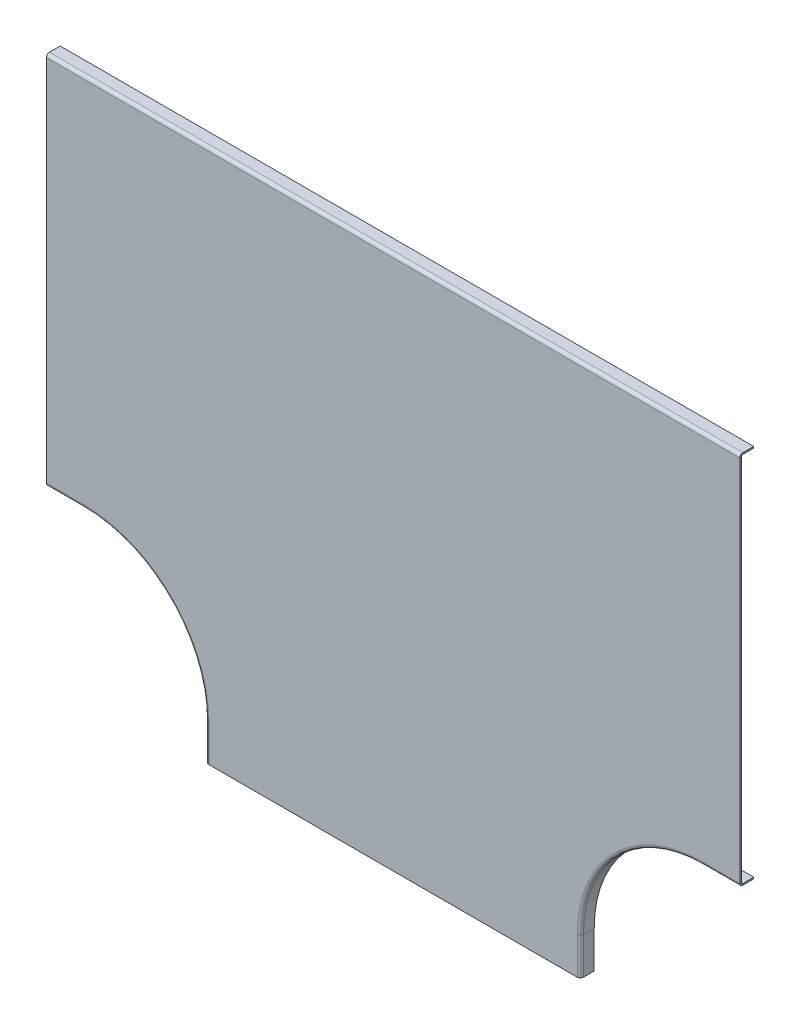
ISO-10303-21;
HEADER;
FILE_DESCRIPTION(('STEP AP214'),'2;1');
FILE_NAME('part.step','',(''),(''),'','','');
FILE_SCHEMA(('AUTOMOTIVE_DESIGN { 1 0 10303 214 1 1 1 1 }'));
ENDSEC;
DATA;
#1=APPLICATION_CONTEXT('core data for automotive mechanical design processes');
#2=APPLICATION_PROTOCOL_DEFINITION('international standard','automotive_design',2000,#1);
#3=PRODUCT_CONTEXT('',#1,'mechanical');
#4=PRODUCT('Part','Part','',(#3));
#5=PRODUCT_RELATED_PRODUCT_CATEGORY('part','',(#4));
#6=PRODUCT_DEFINITION_FORMATION('','',#4);
#7=PRODUCT_DEFINITION_CONTEXT('part definition',#1,'design');
#8=PRODUCT_DEFINITION('design','',#6,#7);
#9=PRODUCT_DEFINITION_SHAPE('','',#8);
#10=(LENGTH_UNIT() NAMED_UNIT(*) SI_UNIT(.MILLI.,.METRE.));
#11=(NAMED_UNIT(*) PLANE_ANGLE_UNIT() SI_UNIT($,.RADIAN.));
#12=(NAMED_UNIT(*) SI_UNIT($,.STERADIAN.) SOLID_ANGLE_UNIT());
#13=UNCERTAINTY_MEASURE_WITH_UNIT(LENGTH_MEASURE(1.E-05),#10,'distance_accuracy_value','');
#14=(GEOMETRIC_REPRESENTATION_CONTEXT(3) GLOBAL_UNCERTAINTY_ASSIGNED_CONTEXT((#13)) GLOBAL_UNIT_ASSIGNED_CONTEXT((#10,
#11,#12)) REPRESENTATION_CONTEXT('',''));
#15=CARTESIAN_POINT('',(0.,0.,0.));
#16=DIRECTION('',(0.,0.,1.));
#17=DIRECTION('',(1.,0.,0.));
#18=AXIS2_PLACEMENT_3D('',#15,#16,#17);
#19=CARTESIAN_POINT('',(-361.048564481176,-315.184007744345,1.21412));
#20=DIRECTION('',(0.,0.,-1.));
#21=DIRECTION('',(-1.,0.,0.));
#22=AXIS2_PLACEMENT_3D('',#19,#20,#21);
#23=PLANE('',#22);
#24=DIRECTION('',(0.,-1.,0.));
#25=VECTOR('',#24,1.);
#26=CARTESIAN_POINT('',(-259.778564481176,-315.184007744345,1.21412));
#27=LINE('',#26,#25);
#28=CARTESIAN_POINT('',(-259.778564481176,-315.184007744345,1.21412));
#29=VERTEX_POINT('',#28);
#30=CARTESIAN_POINT('',(-259.778564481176,-345.184007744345,1.21412));
#31=VERTEX_POINT('',#30);
#32=EDGE_CURVE('E454',#29,#31,#27,.T.);
#33=ORIENTED_EDGE('',*,*,#32,.T.);
#34=DIRECTION('',(1.,0.,0.));
#35=VECTOR('',#34,1.);
#36=CARTESIAN_POINT('',(-261.048564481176,-345.184007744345,1.21412));
#37=LINE('',#36,#35);
#38=CARTESIAN_POINT('',(37.6814355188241,-345.184007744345,1.21412));
#39=VERTEX_POINT('',#38);
#40=EDGE_CURVE('E228',#31,#39,#37,.T.);
#41=ORIENTED_EDGE('',*,*,#40,.T.);
#42=DIRECTION('',(0.,1.,0.));
#43=VECTOR('',#42,1.);
#44=CARTESIAN_POINT('',(37.6814355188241,-345.184007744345,1.21412));
#45=LINE('',#44,#43);
#46=CARTESIAN_POINT('',(37.6814355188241,-315.184007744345,1.21412));
#47=VERTEX_POINT('',#46);
#48=EDGE_CURVE('E571',#39,#47,#45,.T.);
#49=ORIENTED_EDGE('',*,*,#48,.T.);
#50=CARTESIAN_POINT('',(138.951435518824,-315.184007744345,1.21412));
#51=DIRECTION('',(0.,0.,-1.));
#52=DIRECTION('',(-1.,0.,0.));
#53=AXIS2_PLACEMENT_3D('',#50,#51,#52);
#54=CIRCLE('',#53,101.27);
#55=CARTESIAN_POINT('',(138.951435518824,-213.914007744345,1.21412));
#56=VERTEX_POINT('',#55);
#57=EDGE_CURVE('E560',#47,#56,#54,.T.);
#58=ORIENTED_EDGE('',*,*,#57,.T.);
#59=DIRECTION('',(1.,0.,0.));
#60=VECTOR('',#59,1.);
#61=CARTESIAN_POINT('',(138.951435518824,-213.914007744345,1.21412));
#62=LINE('',#61,#60);
#63=CARTESIAN_POINT('',(168.951435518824,-213.914007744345,1.21412));
#64=VERTEX_POINT('',#63);
#65=EDGE_CURVE('E580',#56,#64,#62,.T.);
#66=ORIENTED_EDGE('',*,*,#65,.T.);
#67=DIRECTION('',(0.,1.,0.));
#68=VECTOR('',#67,1.);
#69=CARTESIAN_POINT('',(168.951435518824,-215.184007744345,1.21412));
#70=LINE('',#69,#68);
#71=CARTESIAN_POINT('',(168.951435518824,83.5459922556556,1.21411999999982));
#72=VERTEX_POINT('',#71);
#73=EDGE_CURVE('E14',#64,#72,#70,.T.);
#74=ORIENTED_EDGE('',*,*,#73,.T.);
#75=DIRECTION('',(1.,0.,0.));
#76=VECTOR('',#75,1.);
#77=CARTESIAN_POINT('',(168.951435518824,83.5459922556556,1.21411999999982));
#78=LINE('',#77,#76);
#79=CARTESIAN_POINT('',(-391.048564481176,83.5459922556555,1.21412));
#80=VERTEX_POINT('',#79);
#81=EDGE_CURVE('E692',#72,#80,#78,.F.);
#82=ORIENTED_EDGE('',*,*,#81,.T.);
#83=DIRECTION('',(0.,-1.,0.));
#84=VECTOR('',#83,1.);
#85=CARTESIAN_POINT('',(-391.048564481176,84.8159922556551,1.21412));
#86=LINE('',#85,#84);
#87=CARTESIAN_POINT('',(-391.048564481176,-213.914007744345,1.21412));
#88=VERTEX_POINT('',#87);
#89=EDGE_CURVE('E715',#80,#88,#86,.T.);
#90=ORIENTED_EDGE('',*,*,#89,.T.);
#91=DIRECTION('',(1.,0.,0.));
#92=VECTOR('',#91,1.);
#93=CARTESIAN_POINT('',(-391.048564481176,-213.914007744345,1.21412));
#94=LINE('',#93,#92);
#95=CARTESIAN_POINT('',(-361.048564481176,-213.914007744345,1.21412));
#96=VERTEX_POINT('',#95);
#97=EDGE_CURVE('E236',#88,#96,#94,.T.);
#98=ORIENTED_EDGE('',*,*,#97,.T.);
#99=CARTESIAN_POINT('',(-361.048564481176,-315.184007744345,1.21412));
#100=DIRECTION('',(0.,0.,-1.));
#101=DIRECTION('',(-1.,0.,0.));
#102=AXIS2_PLACEMENT_3D('',#99,#100,#101);
#103=CIRCLE('',#102,101.27);
#104=EDGE_CURVE('E455',#96,#29,#103,.T.);
#105=ORIENTED_EDGE('',*,*,#104,.T.);
#106=EDGE_LOOP('',(#33,#41,#49,#58,#66,#74,#82,#90,#98,#105));
#107=FACE_BOUND('',#106,.T.);
#108=ADVANCED_FACE('F219',(#107),#23,.F.);
#109=CARTESIAN_POINT('',(-361.048564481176,-315.184007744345,0.));
#110=DIRECTION('',(0.,0.,-1.));
#111=DIRECTION('',(-1.,0.,0.));
#112=AXIS2_PLACEMENT_3D('',#109,#110,#111);
#113=PLANE('',#112);
#114=DIRECTION('',(1.,0.,0.));
#115=VECTOR('',#114,1.);
#116=CARTESIAN_POINT('',(-261.048564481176,-345.184007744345,0.));
#117=LINE('',#116,#115);
#118=CARTESIAN_POINT('',(-259.778564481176,-345.184007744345,0.));
#119=VERTEX_POINT('',#118);
#120=CARTESIAN_POINT('',(37.6814355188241,-345.184007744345,0.));
#121=VERTEX_POINT('',#120);
#122=EDGE_CURVE('E718',#119,#121,#117,.T.);
#123=ORIENTED_EDGE('',*,*,#122,.F.);
#124=DIRECTION('',(0.,-1.,0.));
#125=VECTOR('',#124,1.);
#126=CARTESIAN_POINT('',(-259.778564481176,-315.184007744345,0.));
#127=LINE('',#126,#125);
#128=CARTESIAN_POINT('',(-259.778564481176,-315.184007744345,0.));
#129=VERTEX_POINT('',#128);
#130=EDGE_CURVE('E244',#129,#119,#127,.T.);
#131=ORIENTED_EDGE('',*,*,#130,.F.);
#132=CARTESIAN_POINT('',(-361.048564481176,-315.184007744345,0.));
#133=DIRECTION('',(0.,0.,-1.));
#134=DIRECTION('',(0.,1.,0.));
#135=AXIS2_PLACEMENT_3D('',#132,#133,#134);
#136=CIRCLE('',#135,101.27);
#137=CARTESIAN_POINT('',(-361.048564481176,-213.914007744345,0.));
#138=VERTEX_POINT('',#137);
#139=EDGE_CURVE('E500',#138,#129,#136,.T.);
#140=ORIENTED_EDGE('',*,*,#139,.F.);
#141=DIRECTION('',(1.,0.,0.));
#142=VECTOR('',#141,1.);
#143=CARTESIAN_POINT('',(-391.048564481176,-213.914007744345,0.));
#144=LINE('',#143,#142);
#145=CARTESIAN_POINT('',(-391.048564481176,-213.914007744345,0.));
#146=VERTEX_POINT('',#145);
#147=EDGE_CURVE('E491',#146,#138,#144,.T.);
#148=ORIENTED_EDGE('',*,*,#147,.F.);
#149=DIRECTION('',(0.,-1.,0.));
#150=VECTOR('',#149,1.);
#151=CARTESIAN_POINT('',(-391.048564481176,84.8159922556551,0.));
#152=LINE('',#151,#150);
#153=CARTESIAN_POINT('',(-391.048564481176,83.5459922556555,-1.83880688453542E-13));
#154=VERTEX_POINT('',#153);
#155=EDGE_CURVE('E712',#154,#146,#152,.T.);
#156=ORIENTED_EDGE('',*,*,#155,.F.);
#157=DIRECTION('',(1.,0.,0.));
#158=VECTOR('',#157,1.);
#159=CARTESIAN_POINT('',(168.951435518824,83.5459922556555,-1.83880688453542E-13));
#160=LINE('',#159,#158);
#161=CARTESIAN_POINT('',(168.951435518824,83.5459922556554,0.));
#162=VERTEX_POINT('',#161);
#163=EDGE_CURVE('E704',#162,#154,#160,.F.);
#164=ORIENTED_EDGE('',*,*,#163,.F.);
#165=DIRECTION('',(0.,1.,0.));
#166=VECTOR('',#165,1.);
#167=CARTESIAN_POINT('',(168.951435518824,-215.184007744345,0.));
#168=LINE('',#167,#166);
#169=CARTESIAN_POINT('',(168.951435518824,-213.914007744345,0.));
#170=VERTEX_POINT('',#169);
#171=EDGE_CURVE('E223',#170,#162,#168,.T.);
#172=ORIENTED_EDGE('',*,*,#171,.F.);
#173=DIRECTION('',(1.,0.,0.));
#174=VECTOR('',#173,1.);
#175=CARTESIAN_POINT('',(138.951435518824,-213.914007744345,0.));
#176=LINE('',#175,#174);
#177=CARTESIAN_POINT('',(138.951435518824,-213.914007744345,0.));
#178=VERTEX_POINT('',#177);
#179=EDGE_CURVE('E623',#178,#170,#176,.T.);
#180=ORIENTED_EDGE('',*,*,#179,.F.);
#181=CARTESIAN_POINT('',(138.951435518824,-315.184007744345,0.));
#182=DIRECTION('',(0.,0.,-1.));
#183=DIRECTION('',(-1.,0.,0.));
#184=AXIS2_PLACEMENT_3D('',#181,#182,#183);
#185=CIRCLE('',#184,101.27);
#186=CARTESIAN_POINT('',(37.6814355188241,-315.184007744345,0.));
#187=VERTEX_POINT('',#186);
#188=EDGE_CURVE('E613',#187,#178,#185,.T.);
#189=ORIENTED_EDGE('',*,*,#188,.F.);
#190=DIRECTION('',(0.,1.,0.));
#191=VECTOR('',#190,1.);
#192=CARTESIAN_POINT('',(37.6814355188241,-345.184007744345,0.));
#193=LINE('',#192,#191);
#194=EDGE_CURVE('E604',#121,#187,#193,.T.);
#195=ORIENTED_EDGE('',*,*,#194,.F.);
#196=EDGE_LOOP('',(#123,#131,#140,#148,#156,#164,#172,#180,#189,#195));
#197=FACE_BOUND('',#196,.T.);
#198=ADVANCED_FACE('F729',(#197),#113,.T.);
#199=CARTESIAN_POINT('',(-261.048564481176,-345.184007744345,1.21412));
#200=DIRECTION('',(0.,1.,0.));
#201=DIRECTION('',(-1.,0.,0.));
#202=AXIS2_PLACEMENT_3D('',#199,#200,#201);
#203=PLANE('',#202);
#204=DIRECTION('',(0.,0.,1.));
#205=VECTOR('',#204,1.);
#206=CARTESIAN_POINT('',(37.6814355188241,-345.184007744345,0.));
#207=LINE('',#206,#205);
#208=EDGE_CURVE('E652',#121,#39,#207,.T.);
#209=ORIENTED_EDGE('',*,*,#208,.T.);
#210=ORIENTED_EDGE('',*,*,#40,.F.);
#211=DIRECTION('',(0.,0.,1.));
#212=VECTOR('',#211,1.);
#213=CARTESIAN_POINT('',(-259.778564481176,-345.184007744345,0.));
#214=LINE('',#213,#212);
#215=EDGE_CURVE('E540',#119,#31,#214,.T.);
#216=ORIENTED_EDGE('',*,*,#215,.F.);
#217=ORIENTED_EDGE('',*,*,#122,.T.);
#218=EDGE_LOOP('',(#209,#210,#216,#217));
#219=FACE_BOUND('',#218,.T.);
#220=ADVANCED_FACE('F834',(#219),#203,.F.);
#221=CARTESIAN_POINT('',(168.951435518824,-215.184007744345,1.21412));
#222=DIRECTION('',(-1.,0.,0.));
#223=DIRECTION('',(0.,0.,1.));
#224=AXIS2_PLACEMENT_3D('',#221,#222,#223);
#225=PLANE('',#224);
#226=DIRECTION('',(0.,1.20201311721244E-13,1.));
#227=VECTOR('',#226,1.);
#228=CARTESIAN_POINT('',(168.951435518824,83.5459922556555,-1.83880688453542E-13));
#229=LINE('',#228,#227);
#230=EDGE_CURVE('E698',#162,#72,#229,.T.);
#231=ORIENTED_EDGE('',*,*,#230,.T.);
#232=ORIENTED_EDGE('',*,*,#73,.F.);
#233=DIRECTION('',(0.,0.,1.));
#234=VECTOR('',#233,1.);
#235=CARTESIAN_POINT('',(168.951435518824,-213.914007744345,0.));
#236=LINE('',#235,#234);
#237=EDGE_CURVE('E655',#170,#64,#236,.T.);
#238=ORIENTED_EDGE('',*,*,#237,.F.);
#239=ORIENTED_EDGE('',*,*,#171,.T.);
#240=EDGE_LOOP('',(#231,#232,#238,#239));
#241=FACE_BOUND('',#240,.T.);
#242=ADVANCED_FACE('F724',(#241),#225,.F.);
#243=CARTESIAN_POINT('',(-391.048564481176,84.8159922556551,1.21412));
#244=DIRECTION('',(1.,0.,0.));
#245=DIRECTION('',(0.,1.,0.));
#246=AXIS2_PLACEMENT_3D('',#243,#244,#245);
#247=PLANE('',#246);
#248=ORIENTED_EDGE('',*,*,#155,.T.);
#249=DIRECTION('',(0.,0.,1.));
#250=VECTOR('',#249,1.);
#251=CARTESIAN_POINT('',(-391.048564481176,-213.914007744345,0.));
#252=LINE('',#251,#250);
#253=EDGE_CURVE('E537',#146,#88,#252,.T.);
#254=ORIENTED_EDGE('',*,*,#253,.T.);
#255=ORIENTED_EDGE('',*,*,#89,.F.);
#256=DIRECTION('',(0.,1.20201311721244E-13,1.));
#257=VECTOR('',#256,1.);
#258=CARTESIAN_POINT('',(-391.048564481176,83.5459922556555,-1.83880688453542E-13));
#259=LINE('',#258,#257);
#260=EDGE_CURVE('E709',#154,#80,#259,.T.);
#261=ORIENTED_EDGE('',*,*,#260,.F.);
#262=EDGE_LOOP('',(#248,#254,#255,#261));
#263=FACE_BOUND('',#262,.T.);
#264=ADVANCED_FACE('F221',(#263),#247,.F.);
#265=CARTESIAN_POINT('',(-391.048564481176,83.5459922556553,-1.27000000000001));
#266=DIRECTION('',(-1.,0.,0.));
#267=DIRECTION('',(0.,0.,1.));
#268=AXIS2_PLACEMENT_3D('',#265,#266,#267);
#269=PLANE('',#268);
#270=DIRECTION('',(0.,1.,0.));
#271=VECTOR('',#270,1.);
#272=CARTESIAN_POINT('',(-391.048564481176,84.8159922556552,-1.26999999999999));
#273=LINE('',#272,#271);
#274=CARTESIAN_POINT('',(-391.048564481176,84.8159922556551,-1.27000000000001));
#275=VERTEX_POINT('',#274);
#276=CARTESIAN_POINT('',(-391.048564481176,86.0301122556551,-1.27));
#277=VERTEX_POINT('',#276);
#278=EDGE_CURVE('E660',#275,#277,#273,.T.);
#279=ORIENTED_EDGE('',*,*,#278,.F.);
#280=CARTESIAN_POINT('',(-391.048564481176,83.5459922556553,-1.27000000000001));
#281=DIRECTION('',(1.,0.,0.));
#282=DIRECTION('',(0.,0.,-1.));
#283=AXIS2_PLACEMENT_3D('',#280,#281,#282);
#284=CIRCLE('',#283,1.26999999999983);
#285=EDGE_CURVE('E701',#154,#275,#284,.F.);
#286=ORIENTED_EDGE('',*,*,#285,.F.);
#287=ORIENTED_EDGE('',*,*,#260,.T.);
#288=CARTESIAN_POINT('',(-391.048564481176,83.5459922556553,-1.27000000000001));
#289=DIRECTION('',(1.,0.,0.));
#290=DIRECTION('',(0.,0.,-1.));
#291=AXIS2_PLACEMENT_3D('',#288,#289,#290);
#292=CIRCLE('',#291,2.48411999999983);
#293=EDGE_CURVE('E694',#80,#277,#292,.F.);
#294=ORIENTED_EDGE('',*,*,#293,.T.);
#295=EDGE_LOOP('',(#279,#286,#287,#294));
#296=FACE_BOUND('',#295,.T.);
#297=ADVANCED_FACE('F762',(#296),#269,.T.);
#298=CARTESIAN_POINT('',(168.951435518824,83.5459922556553,-1.27000000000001));
#299=DIRECTION('',(-1.,0.,0.));
#300=DIRECTION('',(0.,0.,1.));
#301=AXIS2_PLACEMENT_3D('',#298,#299,#300);
#302=PLANE('',#301);
#303=CARTESIAN_POINT('',(168.951435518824,83.5459922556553,-1.27000000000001));
#304=DIRECTION('',(1.,0.,0.));
#305=DIRECTION('',(0.,0.,-1.));
#306=AXIS2_PLACEMENT_3D('',#303,#304,#305);
#307=CIRCLE('',#306,1.26999999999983);
#308=CARTESIAN_POINT('',(168.951435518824,84.8159922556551,-1.27000000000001));
#309=VERTEX_POINT('',#308);
#310=EDGE_CURVE('E691',#309,#162,#307,.T.);
#311=ORIENTED_EDGE('',*,*,#310,.F.);
#312=DIRECTION('',(0.,1.,0.));
#313=VECTOR('',#312,1.);
#314=CARTESIAN_POINT('',(168.951435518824,84.8159922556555,-1.27000000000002));
#315=LINE('',#314,#313);
#316=CARTESIAN_POINT('',(168.951435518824,86.0301122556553,-1.27000000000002));
#317=VERTEX_POINT('',#316);
#318=EDGE_CURVE('E664',#309,#317,#315,.T.);
#319=ORIENTED_EDGE('',*,*,#318,.T.);
#320=CARTESIAN_POINT('',(168.951435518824,83.5459922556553,-1.27000000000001));
#321=DIRECTION('',(1.,0.,0.));
#322=DIRECTION('',(0.,0.,-1.));
#323=AXIS2_PLACEMENT_3D('',#320,#321,#322);
#324=CIRCLE('',#323,2.48411999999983);
#325=EDGE_CURVE('E695',#317,#72,#324,.T.);
#326=ORIENTED_EDGE('',*,*,#325,.T.);
#327=ORIENTED_EDGE('',*,*,#230,.F.);
#328=EDGE_LOOP('',(#311,#319,#326,#327));
#329=FACE_BOUND('',#328,.T.);
#330=ADVANCED_FACE('F735',(#329),#302,.F.);
#331=CARTESIAN_POINT('',(168.951435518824,83.5459922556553,-1.27000000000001));
#332=DIRECTION('',(1.,0.,0.));
#333=DIRECTION('',(0.,1.,0.));
#334=AXIS2_PLACEMENT_3D('',#331,#332,#333);
#335=CYLINDRICAL_SURFACE('',#334,2.48411999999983);
#336=ORIENTED_EDGE('',*,*,#81,.F.);
#337=ORIENTED_EDGE('',*,*,#325,.F.);
#338=DIRECTION('',(-1.,0.,0.));
#339=VECTOR('',#338,1.);
#340=CARTESIAN_POINT('',(-391.048564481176,86.0301122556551,-1.26999999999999));
#341=LINE('',#340,#339);
#342=EDGE_CURVE('E667',#317,#277,#341,.T.);
#343=ORIENTED_EDGE('',*,*,#342,.T.);
#344=ORIENTED_EDGE('',*,*,#293,.F.);
#345=EDGE_LOOP('',(#336,#337,#343,#344));
#346=FACE_BOUND('',#345,.T.);
#347=ADVANCED_FACE('F760',(#346),#335,.T.);
#348=CARTESIAN_POINT('',(168.951435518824,83.5459922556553,-1.27000000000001));
#349=DIRECTION('',(1.,0.,0.));
#350=DIRECTION('',(0.,1.,0.));
#351=AXIS2_PLACEMENT_3D('',#348,#349,#350);
#352=CYLINDRICAL_SURFACE('',#351,1.26999999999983);
#353=ORIENTED_EDGE('',*,*,#163,.T.);
#354=ORIENTED_EDGE('',*,*,#285,.T.);
#355=DIRECTION('',(1.,0.,0.));
#356=VECTOR('',#355,1.);
#357=CARTESIAN_POINT('',(-391.048564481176,84.8159922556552,-1.26999999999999));
#358=LINE('',#357,#356);
#359=EDGE_CURVE('E662',#275,#309,#358,.T.);
#360=ORIENTED_EDGE('',*,*,#359,.T.);
#361=ORIENTED_EDGE('',*,*,#310,.T.);
#362=EDGE_LOOP('',(#353,#354,#360,#361));
#363=FACE_BOUND('',#362,.T.);
#364=ADVANCED_FACE('F737',(#363),#352,.F.);
#365=CARTESIAN_POINT('',(168.951435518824,86.0301122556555,-10.));
#366=DIRECTION('',(-1.,0.,0.));
#367=DIRECTION('',(0.,-1.,0.));
#368=AXIS2_PLACEMENT_3D('',#365,#366,#367);
#369=PLANE('',#368);
#370=ORIENTED_EDGE('',*,*,#318,.F.);
#371=DIRECTION('',(0.,0.,-1.));
#372=VECTOR('',#371,1.);
#373=CARTESIAN_POINT('',(168.951435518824,84.8159922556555,-10.));
#374=LINE('',#373,#372);
#375=CARTESIAN_POINT('',(168.951435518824,84.8159922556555,-10.));
#376=VERTEX_POINT('',#375);
#377=EDGE_CURVE('E671',#309,#376,#374,.T.);
#378=ORIENTED_EDGE('',*,*,#377,.T.);
#379=DIRECTION('',(0.,-1.,0.));
#380=VECTOR('',#379,1.);
#381=CARTESIAN_POINT('',(168.951435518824,86.0301122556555,-10.));
#382=LINE('',#381,#380);
#383=CARTESIAN_POINT('',(168.951435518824,86.0301122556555,-10.));
#384=VERTEX_POINT('',#383);
#385=EDGE_CURVE('E688',#384,#376,#382,.T.);
#386=ORIENTED_EDGE('',*,*,#385,.F.);
#387=DIRECTION('',(0.,0.,-1.));
#388=VECTOR('',#387,1.);
#389=CARTESIAN_POINT('',(168.951435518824,86.0301122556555,-10.));
#390=LINE('',#389,#388);
#391=EDGE_CURVE('E672',#317,#384,#390,.T.);
#392=ORIENTED_EDGE('',*,*,#391,.F.);
#393=EDGE_LOOP('',(#370,#378,#386,#392));
#394=FACE_BOUND('',#393,.T.);
#395=ADVANCED_FACE('F754',(#394),#369,.F.);
#396=CARTESIAN_POINT('',(-391.048564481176,86.0301122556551,0.));
#397=DIRECTION('',(1.,0.,0.));
#398=DIRECTION('',(0.,1.,0.));
#399=AXIS2_PLACEMENT_3D('',#396,#397,#398);
#400=PLANE('',#399);
#401=ORIENTED_EDGE('',*,*,#278,.T.);
#402=DIRECTION('',(0.,0.,1.));
#403=VECTOR('',#402,1.);
#404=CARTESIAN_POINT('',(-391.048564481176,86.0301122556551,0.));
#405=LINE('',#404,#403);
#406=CARTESIAN_POINT('',(-391.048564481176,86.0301122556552,-10.));
#407=VERTEX_POINT('',#406);
#408=EDGE_CURVE('E677',#407,#277,#405,.T.);
#409=ORIENTED_EDGE('',*,*,#408,.F.);
#410=DIRECTION('',(0.,-1.,0.));
#411=VECTOR('',#410,1.);
#412=CARTESIAN_POINT('',(-391.048564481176,86.0301122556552,-10.));
#413=LINE('',#412,#411);
#414=CARTESIAN_POINT('',(-391.048564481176,84.8159922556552,-10.));
#415=VERTEX_POINT('',#414);
#416=EDGE_CURVE('E680',#407,#415,#413,.T.);
#417=ORIENTED_EDGE('',*,*,#416,.T.);
#418=DIRECTION('',(0.,0.,1.));
#419=VECTOR('',#418,1.);
#420=CARTESIAN_POINT('',(-391.048564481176,84.8159922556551,0.));
#421=LINE('',#420,#419);
#422=EDGE_CURVE('E675',#415,#275,#421,.T.);
#423=ORIENTED_EDGE('',*,*,#422,.T.);
#424=EDGE_LOOP('',(#401,#409,#417,#423));
#425=FACE_BOUND('',#424,.T.);
#426=ADVANCED_FACE('F745',(#425),#400,.F.);
#427=CARTESIAN_POINT('',(-391.048564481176,86.0301122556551,0.));
#428=DIRECTION('',(0.,-1.,0.));
#429=DIRECTION('',(0.,0.,-1.));
#430=AXIS2_PLACEMENT_3D('',#427,#428,#429);
#431=PLANE('',#430);
#432=ORIENTED_EDGE('',*,*,#342,.F.);
#433=ORIENTED_EDGE('',*,*,#391,.T.);
#434=DIRECTION('',(-1.,0.,0.));
#435=VECTOR('',#434,1.);
#436=CARTESIAN_POINT('',(-391.048564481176,86.0301122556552,-10.));
#437=LINE('',#436,#435);
#438=EDGE_CURVE('E674',#384,#407,#437,.T.);
#439=ORIENTED_EDGE('',*,*,#438,.T.);
#440=ORIENTED_EDGE('',*,*,#408,.T.);
#441=EDGE_LOOP('',(#432,#433,#439,#440));
#442=FACE_BOUND('',#441,.T.);
#443=ADVANCED_FACE('F757',(#442),#431,.F.);
#444=CARTESIAN_POINT('',(-391.048564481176,84.8159922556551,0.));
#445=DIRECTION('',(0.,-1.,0.));
#446=DIRECTION('',(0.,0.,-1.));
#447=AXIS2_PLACEMENT_3D('',#444,#445,#446);
#448=PLANE('',#447);
#449=ORIENTED_EDGE('',*,*,#377,.F.);
#450=ORIENTED_EDGE('',*,*,#359,.F.);
#451=ORIENTED_EDGE('',*,*,#422,.F.);
#452=DIRECTION('',(-1.,0.,0.));
#453=VECTOR('',#452,1.);
#454=CARTESIAN_POINT('',(-391.048564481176,84.8159922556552,-10.));
#455=LINE('',#454,#453);
#456=EDGE_CURVE('E682',#376,#415,#455,.T.);
#457=ORIENTED_EDGE('',*,*,#456,.F.);
#458=EDGE_LOOP('',(#449,#450,#451,#457));
#459=FACE_BOUND('',#458,.T.);
#460=ADVANCED_FACE('F742',(#459),#448,.T.);
#461=CARTESIAN_POINT('',(-391.048564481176,86.0301122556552,-10.));
#462=DIRECTION('',(0.,0.,1.));
#463=DIRECTION('',(0.,-1.,0.));
#464=AXIS2_PLACEMENT_3D('',#461,#462,#463);
#465=PLANE('',#464);
#466=ORIENTED_EDGE('',*,*,#456,.T.);
#467=ORIENTED_EDGE('',*,*,#416,.F.);
#468=ORIENTED_EDGE('',*,*,#438,.F.);
#469=ORIENTED_EDGE('',*,*,#385,.T.);
#470=EDGE_LOOP('',(#466,#467,#468,#469));
#471=FACE_BOUND('',#470,.T.);
#472=ADVANCED_FACE('F750',(#471),#465,.F.);
#473=CARTESIAN_POINT('',(168.951435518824,-213.914007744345,-1.27));
#474=DIRECTION('',(1.,0.,0.));
#475=DIRECTION('',(0.,0.,-1.));
#476=AXIS2_PLACEMENT_3D('',#473,#474,#475);
#477=PLANE('',#476);
#478=DIRECTION('',(0.,-1.,0.));
#479=VECTOR('',#478,1.);
#480=CARTESIAN_POINT('',(168.951435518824,-215.184007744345,-1.27));
#481=LINE('',#480,#479);
#482=CARTESIAN_POINT('',(168.951435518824,-215.184007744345,-1.27));
#483=VERTEX_POINT('',#482);
#484=CARTESIAN_POINT('',(168.951435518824,-216.398127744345,-1.26999999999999));
#485=VERTEX_POINT('',#484);
#486=EDGE_CURVE('E658',#483,#485,#481,.T.);
#487=ORIENTED_EDGE('',*,*,#486,.F.);
#488=CARTESIAN_POINT('',(168.951435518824,-213.914007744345,-1.27));
#489=DIRECTION('',(-1.,0.,0.));
#490=DIRECTION('',(0.,0.,-1.));
#491=AXIS2_PLACEMENT_3D('',#488,#489,#490);
#492=CIRCLE('',#491,1.27);
#493=EDGE_CURVE('E619',#170,#483,#492,.F.);
#494=ORIENTED_EDGE('',*,*,#493,.F.);
#495=ORIENTED_EDGE('',*,*,#237,.T.);
#496=CARTESIAN_POINT('',(168.951435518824,-213.914007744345,-1.27));
#497=DIRECTION('',(1.,0.,0.));
#498=DIRECTION('',(0.,0.,-1.));
#499=AXIS2_PLACEMENT_3D('',#496,#497,#498);
#500=CIRCLE('',#499,2.48412);
#501=EDGE_CURVE('E551',#64,#485,#500,.T.);
#502=ORIENTED_EDGE('',*,*,#501,.T.);
#503=EDGE_LOOP('',(#487,#494,#495,#502));
#504=FACE_BOUND('',#503,.T.);
#505=ADVANCED_FACE('F770',(#504),#477,.T.);
#506=CARTESIAN_POINT('',(37.6814355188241,-345.184007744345,-1.27));
#507=DIRECTION('',(0.,1.,0.));
#508=DIRECTION('',(0.,0.,1.));
#509=AXIS2_PLACEMENT_3D('',#506,#507,#508);
#510=PLANE('',#509);
#511=ORIENTED_EDGE('',*,*,#208,.F.);
#512=CARTESIAN_POINT('',(37.6814355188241,-345.184007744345,-1.27));
#513=DIRECTION('',(0.,-1.,0.));
#514=DIRECTION('',(0.,0.,-1.));
#515=AXIS2_PLACEMENT_3D('',#512,#513,#514);
#516=CIRCLE('',#515,1.27);
#517=CARTESIAN_POINT('',(38.9514355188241,-345.184007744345,-1.27));
#518=VERTEX_POINT('',#517);
#519=EDGE_CURVE('E545',#121,#518,#516,.F.);
#520=ORIENTED_EDGE('',*,*,#519,.T.);
#521=DIRECTION('',(1.,0.,0.));
#522=VECTOR('',#521,1.);
#523=CARTESIAN_POINT('',(38.9514355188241,-345.184007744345,-1.27));
#524=LINE('',#523,#522);
#525=CARTESIAN_POINT('',(40.1655555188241,-345.184007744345,-1.26999999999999));
#526=VERTEX_POINT('',#525);
#527=EDGE_CURVE('E650',#518,#526,#524,.T.);
#528=ORIENTED_EDGE('',*,*,#527,.T.);
#529=CARTESIAN_POINT('',(37.6814355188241,-345.184007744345,-1.27));
#530=DIRECTION('',(0.,1.,0.));
#531=DIRECTION('',(0.,0.,1.));
#532=AXIS2_PLACEMENT_3D('',#529,#530,#531);
#533=CIRCLE('',#532,2.48412);
#534=EDGE_CURVE('E586',#39,#526,#533,.T.);
#535=ORIENTED_EDGE('',*,*,#534,.F.);
#536=EDGE_LOOP('',(#511,#520,#528,#535));
#537=FACE_BOUND('',#536,.T.);
#538=ADVANCED_FACE('F846',(#537),#510,.F.);
#539=CARTESIAN_POINT('',(38.9514355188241,-345.184007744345,0.));
#540=DIRECTION('',(0.,-1.,0.));
#541=DIRECTION('',(0.,0.,-1.));
#542=AXIS2_PLACEMENT_3D('',#539,#540,#541);
#543=PLANE('',#542);
#544=ORIENTED_EDGE('',*,*,#527,.F.);
#545=DIRECTION('',(0.,0.,-1.));
#546=VECTOR('',#545,1.);
#547=CARTESIAN_POINT('',(38.9514355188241,-345.184007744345,0.));
#548=LINE('',#547,#546);
#549=CARTESIAN_POINT('',(38.9514355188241,-345.184007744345,-10.000000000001));
#550=VERTEX_POINT('',#549);
#551=EDGE_CURVE('E599',#518,#550,#548,.T.);
#552=ORIENTED_EDGE('',*,*,#551,.T.);
#553=DIRECTION('',(1.,0.,0.));
#554=VECTOR('',#553,1.);
#555=CARTESIAN_POINT('',(38.9514355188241,-345.184007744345,-10.000000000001));
#556=LINE('',#555,#554);
#557=CARTESIAN_POINT('',(40.1655555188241,-345.184007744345,-10.000000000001));
#558=VERTEX_POINT('',#557);
#559=EDGE_CURVE('E648',#550,#558,#556,.T.);
#560=ORIENTED_EDGE('',*,*,#559,.T.);
#561=DIRECTION('',(0.,0.,-1.));
#562=VECTOR('',#561,1.);
#563=CARTESIAN_POINT('',(40.1655555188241,-345.184007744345,0.));
#564=LINE('',#563,#562);
#565=EDGE_CURVE('E583',#526,#558,#564,.T.);
#566=ORIENTED_EDGE('',*,*,#565,.F.);
#567=EDGE_LOOP('',(#544,#552,#560,#566));
#568=FACE_BOUND('',#567,.T.);
#569=ADVANCED_FACE('F856',(#568),#543,.T.);
#570=CARTESIAN_POINT('',(38.9514355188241,-345.184007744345,-10.000000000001));
#571=DIRECTION('',(0.,0.,-1.));
#572=DIRECTION('',(0.,1.,0.));
#573=AXIS2_PLACEMENT_3D('',#570,#571,#572);
#574=PLANE('',#573);
#575=ORIENTED_EDGE('',*,*,#559,.F.);
#576=DIRECTION('',(0.,1.,0.));
#577=VECTOR('',#576,1.);
#578=CARTESIAN_POINT('',(38.9514355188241,-345.184007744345,-10.000000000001));
#579=LINE('',#578,#577);
#580=CARTESIAN_POINT('',(38.9514355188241,-315.184007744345,-10.000000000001));
#581=VERTEX_POINT('',#580);
#582=EDGE_CURVE('E618',#550,#581,#579,.T.);
#583=ORIENTED_EDGE('',*,*,#582,.T.);
#584=DIRECTION('',(1.,0.,0.));
#585=VECTOR('',#584,1.);
#586=CARTESIAN_POINT('',(38.9514355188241,-315.184007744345,-10.000000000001));
#587=LINE('',#586,#585);
#588=CARTESIAN_POINT('',(40.1655555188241,-315.184007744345,-10.000000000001));
#589=VERTEX_POINT('',#588);
#590=EDGE_CURVE('E646',#581,#589,#587,.T.);
#591=ORIENTED_EDGE('',*,*,#590,.T.);
#592=DIRECTION('',(0.,1.,0.));
#593=VECTOR('',#592,1.);
#594=CARTESIAN_POINT('',(40.1655555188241,-345.184007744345,-10.000000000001));
#595=LINE('',#594,#593);
#596=EDGE_CURVE('E566',#558,#589,#595,.T.);
#597=ORIENTED_EDGE('',*,*,#596,.F.);
#598=EDGE_LOOP('',(#575,#583,#591,#597));
#599=FACE_BOUND('',#598,.T.);
#600=ADVANCED_FACE('F857',(#599),#574,.T.);
#601=CARTESIAN_POINT('',(138.951435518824,-315.184007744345,-10.000000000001));
#602=DIRECTION('',(0.,0.,1.));
#603=DIRECTION('',(1.,0.,0.));
#604=AXIS2_PLACEMENT_3D('',#601,#602,#603);
#605=PLANE('',#604);
#606=ORIENTED_EDGE('',*,*,#590,.F.);
#607=CARTESIAN_POINT('',(138.951435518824,-315.184007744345,-10.000000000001));
#608=DIRECTION('',(0.,0.,-1.));
#609=DIRECTION('',(-1.,0.,0.));
#610=AXIS2_PLACEMENT_3D('',#607,#608,#609);
#611=CIRCLE('',#610,100.);
#612=CARTESIAN_POINT('',(138.951435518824,-215.184007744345,-10.000000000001));
#613=VERTEX_POINT('',#612);
#614=EDGE_CURVE('E629',#581,#613,#611,.T.);
#615=ORIENTED_EDGE('',*,*,#614,.T.);
#616=DIRECTION('',(0.,-1.,0.));
#617=VECTOR('',#616,1.);
#618=CARTESIAN_POINT('',(138.951435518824,-215.184007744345,-10.000000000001));
#619=LINE('',#618,#617);
#620=CARTESIAN_POINT('',(138.951435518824,-216.398127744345,-10.000000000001));
#621=VERTEX_POINT('',#620);
#622=EDGE_CURVE('E644',#613,#621,#619,.T.);
#623=ORIENTED_EDGE('',*,*,#622,.T.);
#624=CARTESIAN_POINT('',(138.951435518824,-315.184007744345,-10.000000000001));
#625=DIRECTION('',(0.,0.,-1.));
#626=DIRECTION('',(-1.,0.,0.));
#627=AXIS2_PLACEMENT_3D('',#624,#625,#626);
#628=CIRCLE('',#627,98.78588);
#629=EDGE_CURVE('E555',#589,#621,#628,.T.);
#630=ORIENTED_EDGE('',*,*,#629,.F.);
#631=EDGE_LOOP('',(#606,#615,#623,#630));
#632=FACE_BOUND('',#631,.T.);
#633=ADVANCED_FACE('F798',(#632),#605,.F.);
#634=CARTESIAN_POINT('',(138.951435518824,-215.184007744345,-10.000000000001));
#635=DIRECTION('',(0.,0.,-1.));
#636=DIRECTION('',(1.,0.,0.));
#637=AXIS2_PLACEMENT_3D('',#634,#635,#636);
#638=PLANE('',#637);
#639=ORIENTED_EDGE('',*,*,#622,.F.);
#640=DIRECTION('',(1.,0.,0.));
#641=VECTOR('',#640,1.);
#642=CARTESIAN_POINT('',(138.951435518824,-215.184007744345,-10.000000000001));
#643=LINE('',#642,#641);
#644=CARTESIAN_POINT('',(168.951435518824,-215.184007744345,-10.000000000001));
#645=VERTEX_POINT('',#644);
#646=EDGE_CURVE('E589',#613,#645,#643,.T.);
#647=ORIENTED_EDGE('',*,*,#646,.T.);
#648=DIRECTION('',(0.,-1.,0.));
#649=VECTOR('',#648,1.);
#650=CARTESIAN_POINT('',(168.951435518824,-215.184007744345,-10.000000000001));
#651=LINE('',#650,#649);
#652=CARTESIAN_POINT('',(168.951435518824,-216.398127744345,-10.000000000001));
#653=VERTEX_POINT('',#652);
#654=EDGE_CURVE('E577',#645,#653,#651,.T.);
#655=ORIENTED_EDGE('',*,*,#654,.T.);
#656=DIRECTION('',(1.,0.,0.));
#657=VECTOR('',#656,1.);
#658=CARTESIAN_POINT('',(138.951435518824,-216.398127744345,-10.000000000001));
#659=LINE('',#658,#657);
#660=EDGE_CURVE('E574',#621,#653,#659,.T.);
#661=ORIENTED_EDGE('',*,*,#660,.F.);
#662=EDGE_LOOP('',(#639,#647,#655,#661));
#663=FACE_BOUND('',#662,.T.);
#664=ADVANCED_FACE('F802',(#663),#638,.T.);
#665=CARTESIAN_POINT('',(168.951435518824,-215.184007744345,0.));
#666=DIRECTION('',(-1.,0.,0.));
#667=DIRECTION('',(0.,0.,-1.));
#668=AXIS2_PLACEMENT_3D('',#665,#666,#667);
#669=PLANE('',#668);
#670=DIRECTION('',(0.,0.,-1.));
#671=VECTOR('',#670,1.);
#672=CARTESIAN_POINT('',(168.951435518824,-215.184007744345,0.));
#673=LINE('',#672,#671);
#674=EDGE_CURVE('E626',#483,#645,#673,.T.);
#675=ORIENTED_EDGE('',*,*,#674,.F.);
#676=ORIENTED_EDGE('',*,*,#486,.T.);
#677=DIRECTION('',(0.,0.,-1.));
#678=VECTOR('',#677,1.);
#679=CARTESIAN_POINT('',(168.951435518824,-216.398127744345,0.));
#680=LINE('',#679,#678);
#681=EDGE_CURVE('E550',#485,#653,#680,.T.);
#682=ORIENTED_EDGE('',*,*,#681,.T.);
#683=ORIENTED_EDGE('',*,*,#654,.F.);
#684=EDGE_LOOP('',(#675,#676,#682,#683));
#685=FACE_BOUND('',#684,.T.);
#686=ADVANCED_FACE('F813',(#685),#669,.F.);
#687=CARTESIAN_POINT('',(138.951435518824,-216.398127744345,0.));
#688=DIRECTION('',(0.,-1.,0.));
#689=DIRECTION('',(0.,0.,-1.));
#690=AXIS2_PLACEMENT_3D('',#687,#688,#689);
#691=PLANE('',#690);
#692=ORIENTED_EDGE('',*,*,#660,.T.);
#693=ORIENTED_EDGE('',*,*,#681,.F.);
#694=DIRECTION('',(1.,0.,0.));
#695=VECTOR('',#694,1.);
#696=CARTESIAN_POINT('',(138.951435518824,-216.398127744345,-1.26999999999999));
#697=LINE('',#696,#695);
#698=CARTESIAN_POINT('',(138.951435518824,-216.398127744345,-1.26999999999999));
#699=VERTEX_POINT('',#698);
#700=EDGE_CURVE('E547',#699,#485,#697,.T.);
#701=ORIENTED_EDGE('',*,*,#700,.F.);
#702=DIRECTION('',(0.,0.,-1.));
#703=VECTOR('',#702,1.);
#704=CARTESIAN_POINT('',(138.951435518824,-216.398127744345,0.));
#705=LINE('',#704,#703);
#706=EDGE_CURVE('E552',#699,#621,#705,.T.);
#707=ORIENTED_EDGE('',*,*,#706,.T.);
#708=EDGE_LOOP('',(#692,#693,#701,#707));
#709=FACE_BOUND('',#708,.T.);
#710=ADVANCED_FACE('F777',(#709),#691,.T.);
#711=CARTESIAN_POINT('',(138.951435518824,-213.914007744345,-1.27));
#712=DIRECTION('',(1.,0.,0.));
#713=DIRECTION('',(0.,0.,-1.));
#714=AXIS2_PLACEMENT_3D('',#711,#712,#713);
#715=CYLINDRICAL_SURFACE('',#714,2.48412);
#716=ORIENTED_EDGE('',*,*,#700,.T.);
#717=ORIENTED_EDGE('',*,*,#501,.F.);
#718=ORIENTED_EDGE('',*,*,#65,.F.);
#719=CARTESIAN_POINT('',(138.951435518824,-213.914007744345,-1.27));
#720=DIRECTION('',(1.,0.,0.));
#721=DIRECTION('',(0.,0.,-1.));
#722=AXIS2_PLACEMENT_3D('',#719,#720,#721);
#723=CIRCLE('',#722,2.48412);
#724=EDGE_CURVE('E557',#56,#699,#723,.T.);
#725=ORIENTED_EDGE('',*,*,#724,.T.);
#726=EDGE_LOOP('',(#716,#717,#718,#725));
#727=FACE_BOUND('',#726,.T.);
#728=ADVANCED_FACE('F772',(#727),#715,.T.);
#729=CARTESIAN_POINT('',(138.951435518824,-315.184007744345,0.));
#730=DIRECTION('',(0.,0.,-1.));
#731=DIRECTION('',(-1.,0.,0.));
#732=AXIS2_PLACEMENT_3D('',#729,#730,#731);
#733=CYLINDRICAL_SURFACE('',#732,98.78588);
#734=ORIENTED_EDGE('',*,*,#629,.T.);
#735=ORIENTED_EDGE('',*,*,#706,.F.);
#736=CARTESIAN_POINT('',(138.951435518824,-315.184007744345,-1.26999999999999));
#737=DIRECTION('',(0.,0.,-1.));
#738=DIRECTION('',(-1.,0.,0.));
#739=AXIS2_PLACEMENT_3D('',#736,#737,#738);
#740=CIRCLE('',#739,98.78588);
#741=CARTESIAN_POINT('',(40.1655555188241,-315.184007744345,-1.27));
#742=VERTEX_POINT('',#741);
#743=EDGE_CURVE('E556',#742,#699,#740,.T.);
#744=ORIENTED_EDGE('',*,*,#743,.F.);
#745=DIRECTION('',(0.,0.,-1.));
#746=VECTOR('',#745,1.);
#747=CARTESIAN_POINT('',(40.1655555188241,-315.184007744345,0.));
#748=LINE('',#747,#746);
#749=EDGE_CURVE('E563',#742,#589,#748,.T.);
#750=ORIENTED_EDGE('',*,*,#749,.T.);
#751=EDGE_LOOP('',(#734,#735,#744,#750));
#752=FACE_BOUND('',#751,.T.);
#753=ADVANCED_FACE('F779',(#752),#733,.F.);
#754=CARTESIAN_POINT('',(138.951435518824,-315.184007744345,-1.27));
#755=DIRECTION('',(0.,0.,-1.));
#756=DIRECTION('',(-1.,0.,0.));
#757=AXIS2_PLACEMENT_3D('',#754,#755,#756);
#758=TOROIDAL_SURFACE('',#757,101.27,2.48412);
#759=ORIENTED_EDGE('',*,*,#743,.T.);
#760=ORIENTED_EDGE('',*,*,#724,.F.);
#761=ORIENTED_EDGE('',*,*,#57,.F.);
#762=CARTESIAN_POINT('',(37.6814355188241,-315.184007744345,-1.27));
#763=DIRECTION('',(0.,-1.,0.));
#764=DIRECTION('',(0.,0.,-1.));
#765=AXIS2_PLACEMENT_3D('',#762,#763,#764);
#766=CIRCLE('',#765,2.48412);
#767=EDGE_CURVE('E568',#47,#742,#766,.F.);
#768=ORIENTED_EDGE('',*,*,#767,.T.);
#769=EDGE_LOOP('',(#759,#760,#761,#768));
#770=FACE_BOUND('',#769,.T.);
#771=ADVANCED_FACE('F784',(#770),#758,.T.);
#772=CARTESIAN_POINT('',(40.1655555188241,-345.184007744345,0.));
#773=DIRECTION('',(1.,0.,0.));
#774=DIRECTION('',(0.,0.,-1.));
#775=AXIS2_PLACEMENT_3D('',#772,#773,#774);
#776=PLANE('',#775);
#777=ORIENTED_EDGE('',*,*,#596,.T.);
#778=ORIENTED_EDGE('',*,*,#749,.F.);
#779=DIRECTION('',(0.,1.,0.));
#780=VECTOR('',#779,1.);
#781=CARTESIAN_POINT('',(40.1655555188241,-345.184007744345,-1.26999999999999));
#782=LINE('',#781,#780);
#783=EDGE_CURVE('E567',#526,#742,#782,.T.);
#784=ORIENTED_EDGE('',*,*,#783,.F.);
#785=ORIENTED_EDGE('',*,*,#565,.T.);
#786=EDGE_LOOP('',(#777,#778,#784,#785));
#787=FACE_BOUND('',#786,.T.);
#788=ADVANCED_FACE('F794',(#787),#776,.T.);
#789=CARTESIAN_POINT('',(37.6814355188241,-345.184007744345,-1.27));
#790=DIRECTION('',(0.,1.,0.));
#791=DIRECTION('',(0.,0.,1.));
#792=AXIS2_PLACEMENT_3D('',#789,#790,#791);
#793=CYLINDRICAL_SURFACE('',#792,2.48412);
#794=ORIENTED_EDGE('',*,*,#783,.T.);
#795=ORIENTED_EDGE('',*,*,#767,.F.);
#796=ORIENTED_EDGE('',*,*,#48,.F.);
#797=ORIENTED_EDGE('',*,*,#534,.T.);
#798=EDGE_LOOP('',(#794,#795,#796,#797));
#799=FACE_BOUND('',#798,.T.);
#800=ADVANCED_FACE('F789',(#799),#793,.T.);
#801=CARTESIAN_POINT('',(138.951435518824,-215.184007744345,0.));
#802=DIRECTION('',(0.,-1.,0.));
#803=DIRECTION('',(0.,0.,-1.));
#804=AXIS2_PLACEMENT_3D('',#801,#802,#803);
#805=PLANE('',#804);
#806=ORIENTED_EDGE('',*,*,#646,.F.);
#807=DIRECTION('',(0.,0.,-1.));
#808=VECTOR('',#807,1.);
#809=CARTESIAN_POINT('',(138.951435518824,-215.184007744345,0.));
#810=LINE('',#809,#808);
#811=CARTESIAN_POINT('',(138.951435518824,-215.184007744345,-1.27));
#812=VERTEX_POINT('',#811);
#813=EDGE_CURVE('E615',#812,#613,#810,.T.);
#814=ORIENTED_EDGE('',*,*,#813,.F.);
#815=DIRECTION('',(1.,0.,0.));
#816=VECTOR('',#815,1.);
#817=CARTESIAN_POINT('',(138.951435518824,-215.184007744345,-1.27));
#818=LINE('',#817,#816);
#819=EDGE_CURVE('E622',#812,#483,#818,.T.);
#820=ORIENTED_EDGE('',*,*,#819,.T.);
#821=ORIENTED_EDGE('',*,*,#674,.T.);
#822=EDGE_LOOP('',(#806,#814,#820,#821));
#823=FACE_BOUND('',#822,.T.);
#824=ADVANCED_FACE('F809',(#823),#805,.F.);
#825=CARTESIAN_POINT('',(138.951435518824,-213.914007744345,-1.27));
#826=DIRECTION('',(1.,0.,0.));
#827=DIRECTION('',(0.,0.,-1.));
#828=AXIS2_PLACEMENT_3D('',#825,#826,#827);
#829=CYLINDRICAL_SURFACE('',#828,1.27);
#830=ORIENTED_EDGE('',*,*,#819,.F.);
#831=CARTESIAN_POINT('',(138.951435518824,-213.914007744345,-1.27));
#832=DIRECTION('',(-1.,0.,0.));
#833=DIRECTION('',(0.,0.,-1.));
#834=AXIS2_PLACEMENT_3D('',#831,#832,#833);
#835=CIRCLE('',#834,1.27);
#836=EDGE_CURVE('E609',#178,#812,#835,.F.);
#837=ORIENTED_EDGE('',*,*,#836,.F.);
#838=ORIENTED_EDGE('',*,*,#179,.T.);
#839=ORIENTED_EDGE('',*,*,#493,.T.);
#840=EDGE_LOOP('',(#830,#837,#838,#839));
#841=FACE_BOUND('',#840,.T.);
#842=ADVANCED_FACE('F825',(#841),#829,.F.);
#843=CARTESIAN_POINT('',(138.951435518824,-315.184007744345,0.));
#844=DIRECTION('',(0.,0.,-1.));
#845=DIRECTION('',(-1.,0.,0.));
#846=AXIS2_PLACEMENT_3D('',#843,#844,#845);
#847=CYLINDRICAL_SURFACE('',#846,100.);
#848=ORIENTED_EDGE('',*,*,#614,.F.);
#849=DIRECTION('',(0.,0.,-1.));
#850=VECTOR('',#849,1.);
#851=CARTESIAN_POINT('',(38.9514355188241,-315.184007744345,0.));
#852=LINE('',#851,#850);
#853=CARTESIAN_POINT('',(38.9514355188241,-315.184007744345,-1.27));
#854=VERTEX_POINT('',#853);
#855=EDGE_CURVE('E606',#854,#581,#852,.T.);
#856=ORIENTED_EDGE('',*,*,#855,.F.);
#857=CARTESIAN_POINT('',(138.951435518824,-315.184007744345,-1.27));
#858=DIRECTION('',(0.,0.,-1.));
#859=DIRECTION('',(-1.,0.,0.));
#860=AXIS2_PLACEMENT_3D('',#857,#858,#859);
#861=CIRCLE('',#860,100.);
#862=EDGE_CURVE('E612',#854,#812,#861,.T.);
#863=ORIENTED_EDGE('',*,*,#862,.T.);
#864=ORIENTED_EDGE('',*,*,#813,.T.);
#865=EDGE_LOOP('',(#848,#856,#863,#864));
#866=FACE_BOUND('',#865,.T.);
#867=ADVANCED_FACE('F805',(#866),#847,.T.);
#868=CARTESIAN_POINT('',(138.951435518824,-315.184007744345,-1.27));
#869=DIRECTION('',(0.,0.,-1.));
#870=DIRECTION('',(-1.,0.,0.));
#871=AXIS2_PLACEMENT_3D('',#868,#869,#870);
#872=TOROIDAL_SURFACE('',#871,101.27,1.27);
#873=ORIENTED_EDGE('',*,*,#862,.F.);
#874=CARTESIAN_POINT('',(37.6814355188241,-315.184007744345,-1.27));
#875=DIRECTION('',(0.,-1.,0.));
#876=DIRECTION('',(0.,0.,-1.));
#877=AXIS2_PLACEMENT_3D('',#874,#875,#876);
#878=CIRCLE('',#877,1.27);
#879=EDGE_CURVE('E600',#187,#854,#878,.F.);
#880=ORIENTED_EDGE('',*,*,#879,.F.);
#881=ORIENTED_EDGE('',*,*,#188,.T.);
#882=ORIENTED_EDGE('',*,*,#836,.T.);
#883=EDGE_LOOP('',(#873,#880,#881,#882));
#884=FACE_BOUND('',#883,.T.);
#885=ADVANCED_FACE('F1019',(#884),#872,.F.);
#886=CARTESIAN_POINT('',(38.9514355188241,-345.184007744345,0.));
#887=DIRECTION('',(1.,0.,0.));
#888=DIRECTION('',(0.,0.,-1.));
#889=AXIS2_PLACEMENT_3D('',#886,#887,#888);
#890=PLANE('',#889);
#891=ORIENTED_EDGE('',*,*,#582,.F.);
#892=ORIENTED_EDGE('',*,*,#551,.F.);
#893=DIRECTION('',(0.,1.,0.));
#894=VECTOR('',#893,1.);
#895=CARTESIAN_POINT('',(38.9514355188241,-345.184007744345,-1.27));
#896=LINE('',#895,#894);
#897=EDGE_CURVE('E603',#518,#854,#896,.T.);
#898=ORIENTED_EDGE('',*,*,#897,.T.);
#899=ORIENTED_EDGE('',*,*,#855,.T.);
#900=EDGE_LOOP('',(#891,#892,#898,#899));
#901=FACE_BOUND('',#900,.T.);
#902=ADVANCED_FACE('F854',(#901),#890,.F.);
#903=CARTESIAN_POINT('',(37.6814355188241,-345.184007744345,-1.27));
#904=DIRECTION('',(0.,1.,0.));
#905=DIRECTION('',(0.,0.,1.));
#906=AXIS2_PLACEMENT_3D('',#903,#904,#905);
#907=CYLINDRICAL_SURFACE('',#906,1.27);
#908=ORIENTED_EDGE('',*,*,#897,.F.);
#909=ORIENTED_EDGE('',*,*,#519,.F.);
#910=ORIENTED_EDGE('',*,*,#194,.T.);
#911=ORIENTED_EDGE('',*,*,#879,.T.);
#912=EDGE_LOOP('',(#908,#909,#910,#911));
#913=FACE_BOUND('',#912,.T.);
#914=ADVANCED_FACE('F849',(#913),#907,.F.);
#915=CARTESIAN_POINT('',(-259.778564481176,-345.184007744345,-1.27));
#916=DIRECTION('',(0.,-1.,0.));
#917=DIRECTION('',(0.,0.,-1.));
#918=AXIS2_PLACEMENT_3D('',#915,#916,#917);
#919=PLANE('',#918);
#920=DIRECTION('',(-1.,0.,0.));
#921=VECTOR('',#920,1.);
#922=CARTESIAN_POINT('',(-261.048564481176,-345.184007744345,-1.27));
#923=LINE('',#922,#921);
#924=CARTESIAN_POINT('',(-261.048564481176,-345.184007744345,-1.27));
#925=VERTEX_POINT('',#924);
#926=CARTESIAN_POINT('',(-262.262684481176,-345.184007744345,-1.26999999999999));
#927=VERTEX_POINT('',#926);
#928=EDGE_CURVE('E543',#925,#927,#923,.T.);
#929=ORIENTED_EDGE('',*,*,#928,.F.);
#930=CARTESIAN_POINT('',(-259.778564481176,-345.184007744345,-1.27));
#931=DIRECTION('',(0.,1.,0.));
#932=DIRECTION('',(0.,0.,1.));
#933=AXIS2_PLACEMENT_3D('',#930,#931,#932);
#934=CIRCLE('',#933,1.27);
#935=EDGE_CURVE('E506',#119,#925,#934,.F.);
#936=ORIENTED_EDGE('',*,*,#935,.F.);
#937=ORIENTED_EDGE('',*,*,#215,.T.);
#938=CARTESIAN_POINT('',(-259.778564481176,-345.184007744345,-1.27));
#939=DIRECTION('',(0.,-1.,0.));
#940=DIRECTION('',(0.,0.,-1.));
#941=AXIS2_PLACEMENT_3D('',#938,#939,#940);
#942=CIRCLE('',#941,2.48412);
#943=EDGE_CURVE('E430',#31,#927,#942,.T.);
#944=ORIENTED_EDGE('',*,*,#943,.T.);
#945=EDGE_LOOP('',(#929,#936,#937,#944));
#946=FACE_BOUND('',#945,.T.);
#947=ADVANCED_FACE('F1047',(#946),#919,.T.);
#948=CARTESIAN_POINT('',(-391.048564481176,-213.914007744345,-1.27));
#949=DIRECTION('',(1.,0.,0.));
#950=DIRECTION('',(0.,0.,-1.));
#951=AXIS2_PLACEMENT_3D('',#948,#949,#950);
#952=PLANE('',#951);
#953=ORIENTED_EDGE('',*,*,#253,.F.);
#954=CARTESIAN_POINT('',(-391.048564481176,-213.914007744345,-1.27));
#955=DIRECTION('',(-1.,0.,0.));
#956=DIRECTION('',(0.,0.,1.));
#957=AXIS2_PLACEMENT_3D('',#954,#955,#956);
#958=CIRCLE('',#957,1.27);
#959=CARTESIAN_POINT('',(-391.048564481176,-215.184007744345,-1.27));
#960=VERTEX_POINT('',#959);
#961=EDGE_CURVE('E483',#146,#960,#958,.F.);
#962=ORIENTED_EDGE('',*,*,#961,.T.);
#963=DIRECTION('',(0.,-1.,0.));
#964=VECTOR('',#963,1.);
#965=CARTESIAN_POINT('',(-391.048564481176,-215.184007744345,-1.27));
#966=LINE('',#965,#964);
#967=CARTESIAN_POINT('',(-391.048564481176,-216.398127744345,-1.26999999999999));
#968=VERTEX_POINT('',#967);
#969=EDGE_CURVE('E535',#960,#968,#966,.T.);
#970=ORIENTED_EDGE('',*,*,#969,.T.);
#971=CARTESIAN_POINT('',(-391.048564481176,-213.914007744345,-1.27));
#972=DIRECTION('',(1.,0.,0.));
#973=DIRECTION('',(0.,1.,0.));
#974=AXIS2_PLACEMENT_3D('',#971,#972,#973);
#975=CIRCLE('',#974,2.48412);
#976=EDGE_CURVE('E475',#88,#968,#975,.T.);
#977=ORIENTED_EDGE('',*,*,#976,.F.);
#978=EDGE_LOOP('',(#953,#962,#970,#977));
#979=FACE_BOUND('',#978,.T.);
#980=ADVANCED_FACE('F1170',(#979),#952,.F.);
#981=CARTESIAN_POINT('',(-391.048564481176,-215.184007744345,0.));
#982=DIRECTION('',(-1.,0.,0.));
#983=DIRECTION('',(0.,0.,-1.));
#984=AXIS2_PLACEMENT_3D('',#981,#982,#983);
#985=PLANE('',#984);
#986=ORIENTED_EDGE('',*,*,#969,.F.);
#987=DIRECTION('',(0.,0.,-1.));
#988=VECTOR('',#987,1.);
#989=CARTESIAN_POINT('',(-391.048564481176,-215.184007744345,0.));
#990=LINE('',#989,#988);
#991=CARTESIAN_POINT('',(-391.048564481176,-215.184007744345,-10.0000000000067));
#992=VERTEX_POINT('',#991);
#993=EDGE_CURVE('E486',#960,#992,#990,.T.);
#994=ORIENTED_EDGE('',*,*,#993,.T.);
#995=DIRECTION('',(0.,-1.,0.));
#996=VECTOR('',#995,1.);
#997=CARTESIAN_POINT('',(-391.048564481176,-215.184007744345,-10.0000000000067));
#998=LINE('',#997,#996);
#999=CARTESIAN_POINT('',(-391.048564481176,-216.398127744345,-10.0000000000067));
#1000=VERTEX_POINT('',#999);
#1001=EDGE_CURVE('E533',#992,#1000,#998,.T.);
#1002=ORIENTED_EDGE('',*,*,#1001,.T.);
#1003=DIRECTION('',(0.,0.,-1.));
#1004=VECTOR('',#1003,1.);
#1005=CARTESIAN_POINT('',(-391.048564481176,-216.398127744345,0.));
#1006=LINE('',#1005,#1004);
#1007=EDGE_CURVE('E472',#968,#1000,#1006,.T.);
#1008=ORIENTED_EDGE('',*,*,#1007,.F.);
#1009=EDGE_LOOP('',(#986,#994,#1002,#1008));
#1010=FACE_BOUND('',#1009,.T.);
#1011=ADVANCED_FACE('F1181',(#1010),#985,.T.);
#1012=CARTESIAN_POINT('',(-391.048564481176,-215.184007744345,-10.0000000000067));
#1013=DIRECTION('',(0.,0.,-1.));
#1014=DIRECTION('',(1.,0.,0.));
#1015=AXIS2_PLACEMENT_3D('',#1012,#1013,#1014);
#1016=PLANE('',#1015);
#1017=ORIENTED_EDGE('',*,*,#1001,.F.);
#1018=DIRECTION('',(1.,0.,0.));
#1019=VECTOR('',#1018,1.);
#1020=CARTESIAN_POINT('',(-391.048564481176,-215.184007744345,-10.0000000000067));
#1021=LINE('',#1020,#1019);
#1022=CARTESIAN_POINT('',(-361.048564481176,-215.184007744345,-10.0000000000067));
#1023=VERTEX_POINT('',#1022);
#1024=EDGE_CURVE('E505',#992,#1023,#1021,.T.);
#1025=ORIENTED_EDGE('',*,*,#1024,.T.);
#1026=DIRECTION('',(0.,-1.,0.));
#1027=VECTOR('',#1026,1.);
#1028=CARTESIAN_POINT('',(-361.048564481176,-215.184007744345,-10.0000000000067));
#1029=LINE('',#1028,#1027);
#1030=CARTESIAN_POINT('',(-361.048564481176,-216.398127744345,-10.0000000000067));
#1031=VERTEX_POINT('',#1030);
#1032=EDGE_CURVE('E531',#1023,#1031,#1029,.T.);
#1033=ORIENTED_EDGE('',*,*,#1032,.T.);
#1034=DIRECTION('',(1.,0.,0.));
#1035=VECTOR('',#1034,1.);
#1036=CARTESIAN_POINT('',(-391.048564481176,-216.398127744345,-10.0000000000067));
#1037=LINE('',#1036,#1035);
#1038=EDGE_CURVE('E457',#1000,#1031,#1037,.T.);
#1039=ORIENTED_EDGE('',*,*,#1038,.F.);
#1040=EDGE_LOOP('',(#1017,#1025,#1033,#1039));
#1041=FACE_BOUND('',#1040,.T.);
#1042=ADVANCED_FACE('F1192',(#1041),#1016,.T.);
#1043=CARTESIAN_POINT('',(-361.048564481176,-315.184007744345,-10.0000000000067));
#1044=DIRECTION('',(0.,0.,1.));
#1045=DIRECTION('',(1.,0.,0.));
#1046=AXIS2_PLACEMENT_3D('',#1043,#1044,#1045);
#1047=PLANE('',#1046);
#1048=ORIENTED_EDGE('',*,*,#1032,.F.);
#1049=CARTESIAN_POINT('',(-361.048564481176,-315.184007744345,-10.0000000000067));
#1050=DIRECTION('',(0.,0.,-1.));
#1051=DIRECTION('',(0.,1.,0.));
#1052=AXIS2_PLACEMENT_3D('',#1049,#1050,#1051);
#1053=CIRCLE('',#1052,99.9999999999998);
#1054=CARTESIAN_POINT('',(-261.048564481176,-315.184007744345,-10.0000000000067));
#1055=VERTEX_POINT('',#1054);
#1056=EDGE_CURVE('E514',#1023,#1055,#1053,.T.);
#1057=ORIENTED_EDGE('',*,*,#1056,.T.);
#1058=DIRECTION('',(-1.,0.,0.));
#1059=VECTOR('',#1058,1.);
#1060=CARTESIAN_POINT('',(-261.048564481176,-315.184007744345,-10.0000000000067));
#1061=LINE('',#1060,#1059);
#1062=CARTESIAN_POINT('',(-262.262684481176,-315.184007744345,-10.0000000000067));
#1063=VERTEX_POINT('',#1062);
#1064=EDGE_CURVE('E529',#1055,#1063,#1061,.T.);
#1065=ORIENTED_EDGE('',*,*,#1064,.T.);
#1066=CARTESIAN_POINT('',(-361.048564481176,-315.184007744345,-10.0000000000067));
#1067=DIRECTION('',(0.,0.,-1.));
#1068=DIRECTION('',(-1.,0.,0.));
#1069=AXIS2_PLACEMENT_3D('',#1066,#1067,#1068);
#1070=CIRCLE('',#1069,98.7858799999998);
#1071=EDGE_CURVE('E440',#1031,#1063,#1070,.T.);
#1072=ORIENTED_EDGE('',*,*,#1071,.F.);
#1073=EDGE_LOOP('',(#1048,#1057,#1065,#1072));
#1074=FACE_BOUND('',#1073,.T.);
#1075=ADVANCED_FACE('F1203',(#1074),#1047,.F.);
#1076=CARTESIAN_POINT('',(-261.048564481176,-315.184007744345,-10.0000000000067));
#1077=DIRECTION('',(0.,0.,-1.));
#1078=DIRECTION('',(0.,-1.,0.));
#1079=AXIS2_PLACEMENT_3D('',#1076,#1077,#1078);
#1080=PLANE('',#1079);
#1081=ORIENTED_EDGE('',*,*,#1064,.F.);
#1082=DIRECTION('',(0.,-1.,0.));
#1083=VECTOR('',#1082,1.);
#1084=CARTESIAN_POINT('',(-261.048564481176,-315.184007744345,-10.0000000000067));
#1085=LINE('',#1084,#1083);
#1086=CARTESIAN_POINT('',(-261.048564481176,-345.184007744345,-10.0000000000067));
#1087=VERTEX_POINT('',#1086);
#1088=EDGE_CURVE('E478',#1055,#1087,#1085,.T.);
#1089=ORIENTED_EDGE('',*,*,#1088,.T.);
#1090=DIRECTION('',(-1.,0.,0.));
#1091=VECTOR('',#1090,1.);
#1092=CARTESIAN_POINT('',(-261.048564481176,-345.184007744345,-10.0000000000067));
#1093=LINE('',#1092,#1091);
#1094=CARTESIAN_POINT('',(-262.262684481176,-345.184007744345,-10.0000000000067));
#1095=VERTEX_POINT('',#1094);
#1096=EDGE_CURVE('E468',#1087,#1095,#1093,.T.);
#1097=ORIENTED_EDGE('',*,*,#1096,.T.);
#1098=DIRECTION('',(0.,1.,0.));
#1099=VECTOR('',#1098,1.);
#1100=CARTESIAN_POINT('',(-262.262684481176,-315.184007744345,-10.0000000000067));
#1101=LINE('',#1100,#1099);
#1102=EDGE_CURVE('E466',#1063,#1095,#1101,.F.);
#1103=ORIENTED_EDGE('',*,*,#1102,.F.);
#1104=EDGE_LOOP('',(#1081,#1089,#1097,#1103));
#1105=FACE_BOUND('',#1104,.T.);
#1106=ADVANCED_FACE('F1214',(#1105),#1080,.T.);
#1107=CARTESIAN_POINT('',(-261.048564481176,-345.184007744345,0.));
#1108=DIRECTION('',(0.,1.,0.));
#1109=DIRECTION('',(0.,0.,-1.));
#1110=AXIS2_PLACEMENT_3D('',#1107,#1108,#1109);
#1111=PLANE('',#1110);
#1112=DIRECTION('',(0.,0.,-1.));
#1113=VECTOR('',#1112,1.);
#1114=CARTESIAN_POINT('',(-261.048564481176,-345.184007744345,0.));
#1115=LINE('',#1114,#1113);
#1116=EDGE_CURVE('E512',#925,#1087,#1115,.T.);
#1117=ORIENTED_EDGE('',*,*,#1116,.F.);
#1118=ORIENTED_EDGE('',*,*,#928,.T.);
#1119=DIRECTION('',(0.,0.,1.));
#1120=VECTOR('',#1119,1.);
#1121=CARTESIAN_POINT('',(-262.262684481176,-345.184007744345,0.));
#1122=LINE('',#1121,#1120);
#1123=EDGE_CURVE('E425',#927,#1095,#1122,.F.);
#1124=ORIENTED_EDGE('',*,*,#1123,.T.);
#1125=ORIENTED_EDGE('',*,*,#1096,.F.);
#1126=EDGE_LOOP('',(#1117,#1118,#1124,#1125));
#1127=FACE_BOUND('',#1126,.T.);
#1128=ADVANCED_FACE('F1225',(#1127),#1111,.F.);
#1129=CARTESIAN_POINT('',(-262.262684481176,-315.184007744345,0.));
#1130=DIRECTION('',(-1.,0.,0.));
#1131=DIRECTION('',(0.,0.,1.));
#1132=AXIS2_PLACEMENT_3D('',#1129,#1130,#1131);
#1133=PLANE('',#1132);
#1134=ORIENTED_EDGE('',*,*,#1102,.T.);
#1135=ORIENTED_EDGE('',*,*,#1123,.F.);
#1136=DIRECTION('',(0.,-1.,0.));
#1137=VECTOR('',#1136,1.);
#1138=CARTESIAN_POINT('',(-262.262684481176,-315.184007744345,-1.26999999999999));
#1139=LINE('',#1138,#1137);
#1140=CARTESIAN_POINT('',(-262.262684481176,-315.184007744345,-1.26999999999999));
#1141=VERTEX_POINT('',#1140);
#1142=EDGE_CURVE('E419',#1141,#927,#1139,.T.);
#1143=ORIENTED_EDGE('',*,*,#1142,.F.);
#1144=DIRECTION('',(0.,0.,1.));
#1145=VECTOR('',#1144,1.);
#1146=CARTESIAN_POINT('',(-262.262684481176,-315.184007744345,0.));
#1147=LINE('',#1146,#1145);
#1148=EDGE_CURVE('E423',#1141,#1063,#1147,.F.);
#1149=ORIENTED_EDGE('',*,*,#1148,.T.);
#1150=EDGE_LOOP('',(#1134,#1135,#1143,#1149));
#1151=FACE_BOUND('',#1150,.T.);
#1152=ADVANCED_FACE('F422',(#1151),#1133,.T.);
#1153=CARTESIAN_POINT('',(-259.778564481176,-315.184007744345,-1.27));
#1154=DIRECTION('',(0.,-1.,0.));
#1155=DIRECTION('',(0.,0.,-1.));
#1156=AXIS2_PLACEMENT_3D('',#1153,#1154,#1155);
#1157=CYLINDRICAL_SURFACE('',#1156,2.48412);
#1158=ORIENTED_EDGE('',*,*,#1142,.T.);
#1159=ORIENTED_EDGE('',*,*,#943,.F.);
#1160=ORIENTED_EDGE('',*,*,#32,.F.);
#1161=CARTESIAN_POINT('',(-259.778564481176,-315.184007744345,-1.27));
#1162=DIRECTION('',(0.,-1.,0.));
#1163=DIRECTION('',(0.,0.,-1.));
#1164=AXIS2_PLACEMENT_3D('',#1161,#1162,#1163);
#1165=CIRCLE('',#1164,2.48412);
#1166=EDGE_CURVE('E447',#29,#1141,#1165,.T.);
#1167=ORIENTED_EDGE('',*,*,#1166,.T.);
#1168=EDGE_LOOP('',(#1158,#1159,#1160,#1167));
#1169=FACE_BOUND('',#1168,.T.);
#1170=ADVANCED_FACE('F452',(#1169),#1157,.T.);
#1171=CARTESIAN_POINT('',(-361.048564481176,-315.184007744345,0.));
#1172=DIRECTION('',(0.,0.,-1.));
#1173=DIRECTION('',(-1.,0.,0.));
#1174=AXIS2_PLACEMENT_3D('',#1171,#1172,#1173);
#1175=CYLINDRICAL_SURFACE('',#1174,98.7858799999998);
#1176=ORIENTED_EDGE('',*,*,#1071,.T.);
#1177=ORIENTED_EDGE('',*,*,#1148,.F.);
#1178=CARTESIAN_POINT('',(-361.048564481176,-315.184007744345,-1.26999999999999));
#1179=DIRECTION('',(0.,0.,-1.));
#1180=DIRECTION('',(-1.,0.,0.));
#1181=AXIS2_PLACEMENT_3D('',#1178,#1179,#1180);
#1182=CIRCLE('',#1181,98.7858799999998);
#1183=CARTESIAN_POINT('',(-361.048564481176,-216.398127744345,-1.27));
#1184=VERTEX_POINT('',#1183);
#1185=EDGE_CURVE('E437',#1184,#1141,#1182,.T.);
#1186=ORIENTED_EDGE('',*,*,#1185,.F.);
#1187=DIRECTION('',(0.,0.,-1.));
#1188=VECTOR('',#1187,1.);
#1189=CARTESIAN_POINT('',(-361.048564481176,-216.398127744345,0.));
#1190=LINE('',#1189,#1188);
#1191=EDGE_CURVE('E460',#1184,#1031,#1190,.T.);
#1192=ORIENTED_EDGE('',*,*,#1191,.T.);
#1193=EDGE_LOOP('',(#1176,#1177,#1186,#1192));
#1194=FACE_BOUND('',#1193,.T.);
#1195=ADVANCED_FACE('F435',(#1194),#1175,.F.);
#1196=CARTESIAN_POINT('',(-361.048564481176,-315.184007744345,-1.27));
#1197=DIRECTION('',(0.,0.,-1.));
#1198=DIRECTION('',(-1.,0.,0.));
#1199=AXIS2_PLACEMENT_3D('',#1196,#1197,#1198);
#1200=TOROIDAL_SURFACE('',#1199,101.27,2.48412);
#1201=ORIENTED_EDGE('',*,*,#1185,.T.);
#1202=ORIENTED_EDGE('',*,*,#1166,.F.);
#1203=ORIENTED_EDGE('',*,*,#104,.F.);
#1204=CARTESIAN_POINT('',(-361.048564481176,-213.914007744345,-1.27));
#1205=DIRECTION('',(-1.,0.,0.));
#1206=DIRECTION('',(0.,-1.,0.));
#1207=AXIS2_PLACEMENT_3D('',#1204,#1205,#1206);
#1208=CIRCLE('',#1207,2.48412);
#1209=EDGE_CURVE('E449',#96,#1184,#1208,.F.);
#1210=ORIENTED_EDGE('',*,*,#1209,.T.);
#1211=EDGE_LOOP('',(#1201,#1202,#1203,#1210));
#1212=FACE_BOUND('',#1211,.T.);
#1213=ADVANCED_FACE('F446',(#1212),#1200,.T.);
#1214=CARTESIAN_POINT('',(-391.048564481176,-216.398127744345,0.));
#1215=DIRECTION('',(0.,-1.,0.));
#1216=DIRECTION('',(0.,0.,-1.));
#1217=AXIS2_PLACEMENT_3D('',#1214,#1215,#1216);
#1218=PLANE('',#1217);
#1219=ORIENTED_EDGE('',*,*,#1038,.T.);
#1220=ORIENTED_EDGE('',*,*,#1191,.F.);
#1221=DIRECTION('',(1.,0.,0.));
#1222=VECTOR('',#1221,1.);
#1223=CARTESIAN_POINT('',(-391.048564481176,-216.398127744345,-1.26999999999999));
#1224=LINE('',#1223,#1222);
#1225=EDGE_CURVE('E462',#968,#1184,#1224,.T.);
#1226=ORIENTED_EDGE('',*,*,#1225,.F.);
#1227=ORIENTED_EDGE('',*,*,#1007,.T.);
#1228=EDGE_LOOP('',(#1219,#1220,#1226,#1227));
#1229=FACE_BOUND('',#1228,.T.);
#1230=ADVANCED_FACE('F1275',(#1229),#1218,.T.);
#1231=CARTESIAN_POINT('',(-391.048564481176,-213.914007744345,-1.27));
#1232=DIRECTION('',(1.,0.,0.));
#1233=DIRECTION('',(0.,1.,0.));
#1234=AXIS2_PLACEMENT_3D('',#1231,#1232,#1233);
#1235=CYLINDRICAL_SURFACE('',#1234,2.48412);
#1236=ORIENTED_EDGE('',*,*,#1225,.T.);
#1237=ORIENTED_EDGE('',*,*,#1209,.F.);
#1238=ORIENTED_EDGE('',*,*,#97,.F.);
#1239=ORIENTED_EDGE('',*,*,#976,.T.);
#1240=EDGE_LOOP('',(#1236,#1237,#1238,#1239));
#1241=FACE_BOUND('',#1240,.T.);
#1242=ADVANCED_FACE('F1239',(#1241),#1235,.T.);
#1243=CARTESIAN_POINT('',(-261.048564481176,-315.184007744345,0.));
#1244=DIRECTION('',(-1.,0.,0.));
#1245=DIRECTION('',(0.,0.,1.));
#1246=AXIS2_PLACEMENT_3D('',#1243,#1244,#1245);
#1247=PLANE('',#1246);
#1248=ORIENTED_EDGE('',*,*,#1088,.F.);
#1249=DIRECTION('',(0.,0.,-1.));
#1250=VECTOR('',#1249,1.);
#1251=CARTESIAN_POINT('',(-261.048564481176,-315.184007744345,0.));
#1252=LINE('',#1251,#1250);
#1253=CARTESIAN_POINT('',(-261.048564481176,-315.184007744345,-1.27));
#1254=VERTEX_POINT('',#1253);
#1255=EDGE_CURVE('E502',#1254,#1055,#1252,.T.);
#1256=ORIENTED_EDGE('',*,*,#1255,.F.);
#1257=DIRECTION('',(0.,-1.,0.));
#1258=VECTOR('',#1257,1.);
#1259=CARTESIAN_POINT('',(-261.048564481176,-315.184007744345,-1.27));
#1260=LINE('',#1259,#1258);
#1261=EDGE_CURVE('E509',#1254,#925,#1260,.T.);
#1262=ORIENTED_EDGE('',*,*,#1261,.T.);
#1263=ORIENTED_EDGE('',*,*,#1116,.T.);
#1264=EDGE_LOOP('',(#1248,#1256,#1262,#1263));
#1265=FACE_BOUND('',#1264,.T.);
#1266=ADVANCED_FACE('F1238',(#1265),#1247,.F.);
#1267=CARTESIAN_POINT('',(-259.778564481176,-315.184007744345,-1.27));
#1268=DIRECTION('',(0.,-1.,0.));
#1269=DIRECTION('',(0.,0.,-1.));
#1270=AXIS2_PLACEMENT_3D('',#1267,#1268,#1269);
#1271=CYLINDRICAL_SURFACE('',#1270,1.27);
#1272=ORIENTED_EDGE('',*,*,#1261,.F.);
#1273=CARTESIAN_POINT('',(-259.778564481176,-315.184007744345,-1.27));
#1274=DIRECTION('',(0.,1.,0.));
#1275=DIRECTION('',(0.,0.,1.));
#1276=AXIS2_PLACEMENT_3D('',#1273,#1274,#1275);
#1277=CIRCLE('',#1276,1.27);
#1278=EDGE_CURVE('E496',#129,#1254,#1277,.F.);
#1279=ORIENTED_EDGE('',*,*,#1278,.F.);
#1280=ORIENTED_EDGE('',*,*,#130,.T.);
#1281=ORIENTED_EDGE('',*,*,#935,.T.);
#1282=EDGE_LOOP('',(#1272,#1279,#1280,#1281));
#1283=FACE_BOUND('',#1282,.T.);
#1284=ADVANCED_FACE('F1305',(#1283),#1271,.F.);
#1285=CARTESIAN_POINT('',(-361.048564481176,-315.184007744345,0.));
#1286=DIRECTION('',(0.,0.,-1.));
#1287=DIRECTION('',(-1.,0.,0.));
#1288=AXIS2_PLACEMENT_3D('',#1285,#1286,#1287);
#1289=CYLINDRICAL_SURFACE('',#1288,99.9999999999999);
#1290=ORIENTED_EDGE('',*,*,#1056,.F.);
#1291=DIRECTION('',(0.,0.,-1.));
#1292=VECTOR('',#1291,1.);
#1293=CARTESIAN_POINT('',(-361.048564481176,-215.184007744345,0.));
#1294=LINE('',#1293,#1292);
#1295=CARTESIAN_POINT('',(-361.048564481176,-215.184007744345,-1.27));
#1296=VERTEX_POINT('',#1295);
#1297=EDGE_CURVE('E493',#1296,#1023,#1294,.T.);
#1298=ORIENTED_EDGE('',*,*,#1297,.F.);
#1299=CARTESIAN_POINT('',(-361.048564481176,-315.184007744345,-1.27));
#1300=DIRECTION('',(0.,0.,-1.));
#1301=DIRECTION('',(0.,1.,0.));
#1302=AXIS2_PLACEMENT_3D('',#1299,#1300,#1301);
#1303=CIRCLE('',#1302,99.9999999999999);
#1304=EDGE_CURVE('E499',#1296,#1254,#1303,.T.);
#1305=ORIENTED_EDGE('',*,*,#1304,.T.);
#1306=ORIENTED_EDGE('',*,*,#1255,.T.);
#1307=EDGE_LOOP('',(#1290,#1298,#1305,#1306));
#1308=FACE_BOUND('',#1307,.T.);
#1309=ADVANCED_FACE('F1316',(#1308),#1289,.T.);
#1310=CARTESIAN_POINT('',(-361.048564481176,-315.184007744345,-1.27));
#1311=DIRECTION('',(0.,0.,-1.));
#1312=DIRECTION('',(-1.,0.,0.));
#1313=AXIS2_PLACEMENT_3D('',#1310,#1311,#1312);
#1314=TOROIDAL_SURFACE('',#1313,101.27,1.27);
#1315=ORIENTED_EDGE('',*,*,#1304,.F.);
#1316=CARTESIAN_POINT('',(-361.048564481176,-213.914007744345,-1.27));
#1317=DIRECTION('',(-1.,0.,0.));
#1318=DIRECTION('',(0.,0.,1.));
#1319=AXIS2_PLACEMENT_3D('',#1316,#1317,#1318);
#1320=CIRCLE('',#1319,1.27);
#1321=EDGE_CURVE('E487',#138,#1296,#1320,.F.);
#1322=ORIENTED_EDGE('',*,*,#1321,.F.);
#1323=ORIENTED_EDGE('',*,*,#139,.T.);
#1324=ORIENTED_EDGE('',*,*,#1278,.T.);
#1325=EDGE_LOOP('',(#1315,#1322,#1323,#1324));
#1326=FACE_BOUND('',#1325,.T.);
#1327=ADVANCED_FACE('F1327',(#1326),#1314,.F.);
#1328=CARTESIAN_POINT('',(-391.048564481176,-215.184007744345,0.));
#1329=DIRECTION('',(0.,-1.,0.));
#1330=DIRECTION('',(0.,0.,-1.));
#1331=AXIS2_PLACEMENT_3D('',#1328,#1329,#1330);
#1332=PLANE('',#1331);
#1333=ORIENTED_EDGE('',*,*,#1024,.F.);
#1334=ORIENTED_EDGE('',*,*,#993,.F.);
#1335=DIRECTION('',(1.,0.,0.));
#1336=VECTOR('',#1335,1.);
#1337=CARTESIAN_POINT('',(-391.048564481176,-215.184007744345,-1.27));
#1338=LINE('',#1337,#1336);
#1339=EDGE_CURVE('E490',#960,#1296,#1338,.T.);
#1340=ORIENTED_EDGE('',*,*,#1339,.T.);
#1341=ORIENTED_EDGE('',*,*,#1297,.T.);
#1342=EDGE_LOOP('',(#1333,#1334,#1340,#1341));
#1343=FACE_BOUND('',#1342,.T.);
#1344=ADVANCED_FACE('F1338',(#1343),#1332,.F.);
#1345=CARTESIAN_POINT('',(-391.048564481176,-213.914007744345,-1.27));
#1346=DIRECTION('',(1.,0.,0.));
#1347=DIRECTION('',(0.,1.,0.));
#1348=AXIS2_PLACEMENT_3D('',#1345,#1346,#1347);
#1349=CYLINDRICAL_SURFACE('',#1348,1.27);
#1350=ORIENTED_EDGE('',*,*,#1339,.F.);
#1351=ORIENTED_EDGE('',*,*,#961,.F.);
#1352=ORIENTED_EDGE('',*,*,#147,.T.);
#1353=ORIENTED_EDGE('',*,*,#1321,.T.);
#1354=EDGE_LOOP('',(#1350,#1351,#1352,#1353));
#1355=FACE_BOUND('',#1354,.T.);
#1356=ADVANCED_FACE('F1349',(#1355),#1349,.F.);
#1357=CLOSED_SHELL('',(#108,#198,#220,#242,#264,#297,#330,#347,#364,#395,#426,#443,#460,#472,
#505,#538,#569,#600,#633,#664,#686,#710,#728,#753,#771,#788,#800,#824,#842,#867,#885,#902,#914,
#947,#980,#1011,#1042,#1075,#1106,#1128,#1152,#1170,#1195,#1213,#1230,#1242,#1266,#1284,#1309,
#1327,#1344,#1356));
#1358=MANIFOLD_SOLID_BREP('B2',#1357);
#1359=ADVANCED_BREP_SHAPE_REPRESENTATION('',(#18,#1358),#14);
#1360=SHAPE_DEFINITION_REPRESENTATION(#9,#1359);
ENDSEC;
END-ISO-10303-21;
